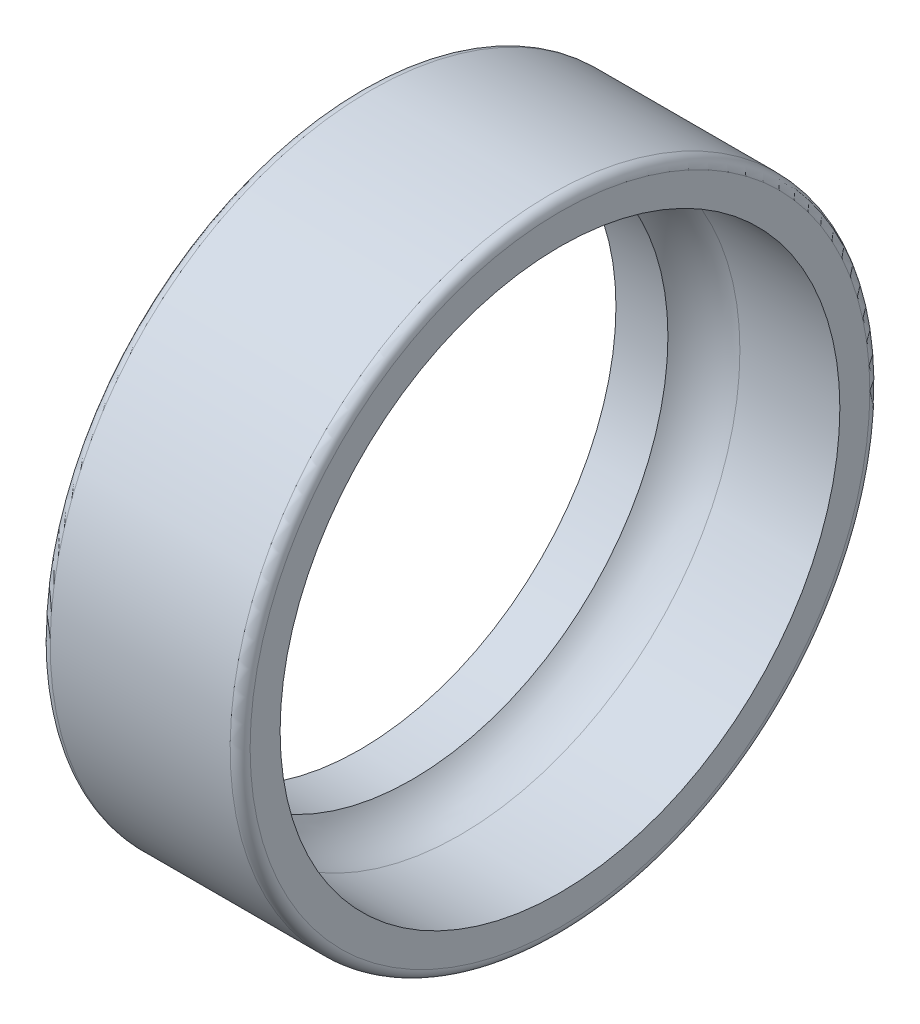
ISO-10303-21;
HEADER;
FILE_DESCRIPTION(('STEP AP214'),'2;1');
FILE_NAME('part.step','',(''),(''),'','','');
FILE_SCHEMA(('AUTOMOTIVE_DESIGN { 1 0 10303 214 1 1 1 1 }'));
ENDSEC;
DATA;
#1=APPLICATION_CONTEXT('core data for automotive mechanical design processes');
#2=APPLICATION_PROTOCOL_DEFINITION('international standard','automotive_design',2000,#1);
#3=PRODUCT_CONTEXT('',#1,'mechanical');
#4=PRODUCT('Part','Part','',(#3));
#5=PRODUCT_RELATED_PRODUCT_CATEGORY('part','',(#4));
#6=PRODUCT_DEFINITION_FORMATION('','',#4);
#7=PRODUCT_DEFINITION_CONTEXT('part definition',#1,'design');
#8=PRODUCT_DEFINITION('design','',#6,#7);
#9=PRODUCT_DEFINITION_SHAPE('','',#8);
#10=(LENGTH_UNIT() NAMED_UNIT(*) SI_UNIT(.MILLI.,.METRE.));
#11=(NAMED_UNIT(*) PLANE_ANGLE_UNIT() SI_UNIT($,.RADIAN.));
#12=(NAMED_UNIT(*) SI_UNIT($,.STERADIAN.) SOLID_ANGLE_UNIT());
#13=UNCERTAINTY_MEASURE_WITH_UNIT(LENGTH_MEASURE(1.E-05),#10,'distance_accuracy_value','');
#14=(GEOMETRIC_REPRESENTATION_CONTEXT(3) GLOBAL_UNCERTAINTY_ASSIGNED_CONTEXT((#13)) GLOBAL_UNIT_ASSIGNED_CONTEXT((#10,
#11,#12)) REPRESENTATION_CONTEXT('',''));
#15=CARTESIAN_POINT('',(0.,0.,0.));
#16=DIRECTION('',(0.,0.,1.));
#17=DIRECTION('',(1.,0.,0.));
#18=AXIS2_PLACEMENT_3D('',#15,#16,#17);
#19=CARTESIAN_POINT('',(0.,14.15,0.));
#20=DIRECTION('',(-1.,0.,0.));
#21=DIRECTION('',(0.,0.,1.));
#22=AXIS2_PLACEMENT_3D('',#19,#20,#21);
#23=PLANE('',#22);
#24=CARTESIAN_POINT('',(0.,0.,0.));
#25=DIRECTION('',(-1.,0.,0.));
#26=DIRECTION('',(0.,1.,0.));
#27=AXIS2_PLACEMENT_3D('',#24,#25,#26);
#28=CIRCLE('',#27,12.8);
#29=CARTESIAN_POINT('',(0.,12.8,0.));
#30=VERTEX_POINT('',#29);
#31=EDGE_CURVE('E33',#30,#30,#28,.T.);
#32=ORIENTED_EDGE('',*,*,#31,.F.);
#33=EDGE_LOOP('',(#32));
#34=FACE_BOUND('',#33,.T.);
#35=CARTESIAN_POINT('',(0.,0.,0.));
#36=DIRECTION('',(-1.,0.,0.));
#37=DIRECTION('',(0.,1.,0.));
#38=AXIS2_PLACEMENT_3D('',#35,#36,#37);
#39=CIRCLE('',#38,15.5);
#40=CARTESIAN_POINT('',(0.,15.5,0.));
#41=VERTEX_POINT('',#40);
#42=EDGE_CURVE('E10',#41,#41,#39,.T.);
#43=ORIENTED_EDGE('',*,*,#42,.T.);
#44=EDGE_LOOP('',(#43));
#45=FACE_BOUND('',#44,.T.);
#46=ADVANCED_FACE('F15',(#34,#45),#23,.T.);
#47=CARTESIAN_POINT('',(10.,14.75,0.));
#48=DIRECTION('',(1.,0.,0.));
#49=DIRECTION('',(0.,0.,-1.));
#50=AXIS2_PLACEMENT_3D('',#47,#48,#49);
#51=PLANE('',#50);
#52=CARTESIAN_POINT('',(10.,0.,0.));
#53=DIRECTION('',(-1.,0.,0.));
#54=DIRECTION('',(0.,1.,0.));
#55=AXIS2_PLACEMENT_3D('',#52,#53,#54);
#56=CIRCLE('',#55,14.);
#57=CARTESIAN_POINT('',(10.,14.,0.));
#58=VERTEX_POINT('',#57);
#59=EDGE_CURVE('E24',#58,#58,#56,.T.);
#60=ORIENTED_EDGE('',*,*,#59,.T.);
#61=EDGE_LOOP('',(#60));
#62=FACE_BOUND('',#61,.T.);
#63=CARTESIAN_POINT('',(10.,0.,0.));
#64=DIRECTION('',(-1.,0.,0.));
#65=DIRECTION('',(0.,1.,0.));
#66=AXIS2_PLACEMENT_3D('',#63,#64,#65);
#67=CIRCLE('',#66,15.5);
#68=CARTESIAN_POINT('',(10.,15.5,0.));
#69=VERTEX_POINT('',#68);
#70=EDGE_CURVE('E81',#69,#69,#67,.T.);
#71=ORIENTED_EDGE('',*,*,#70,.F.);
#72=EDGE_LOOP('',(#71));
#73=FACE_BOUND('',#72,.T.);
#74=ADVANCED_FACE('F46',(#62,#73),#51,.T.);
#75=CARTESIAN_POINT('',(1.3,0.,0.));
#76=DIRECTION('',(-1.,0.,0.));
#77=DIRECTION('',(0.,0.,1.));
#78=AXIS2_PLACEMENT_3D('',#75,#76,#77);
#79=CYLINDRICAL_SURFACE('',#78,12.8);
#80=CARTESIAN_POINT('',(2.6,0.,0.));
#81=DIRECTION('',(-1.,0.,0.));
#82=DIRECTION('',(0.,1.,0.));
#83=AXIS2_PLACEMENT_3D('',#80,#81,#82);
#84=CIRCLE('',#83,12.8);
#85=CARTESIAN_POINT('',(2.6,12.8,0.));
#86=VERTEX_POINT('',#85);
#87=EDGE_CURVE('E75',#86,#86,#84,.T.);
#88=ORIENTED_EDGE('',*,*,#87,.F.);
#89=EDGE_LOOP('',(#88));
#90=FACE_BOUND('',#89,.T.);
#91=ORIENTED_EDGE('',*,*,#31,.T.);
#92=EDGE_LOOP('',(#91));
#93=FACE_BOUND('',#92,.T.);
#94=ADVANCED_FACE('F44',(#90,#93),#79,.F.);
#95=CARTESIAN_POINT('',(5.,0.,0.));
#96=DIRECTION('',(-1.,0.,0.));
#97=DIRECTION('',(0.,0.,1.));
#98=AXIS2_PLACEMENT_3D('',#95,#96,#97);
#99=TOROIDAL_SURFACE('',#98,11.,3.);
#100=ORIENTED_EDGE('',*,*,#87,.T.);
#101=EDGE_LOOP('',(#100));
#102=FACE_BOUND('',#101,.T.);
#103=CARTESIAN_POINT('',(5.,0.,0.));
#104=DIRECTION('',(-1.,0.,0.));
#105=DIRECTION('',(0.,1.,0.));
#106=AXIS2_PLACEMENT_3D('',#103,#104,#105);
#107=CIRCLE('',#106,14.);
#108=CARTESIAN_POINT('',(5.,14.,0.));
#109=VERTEX_POINT('',#108);
#110=EDGE_CURVE('E93',#109,#109,#107,.T.);
#111=ORIENTED_EDGE('',*,*,#110,.F.);
#112=EDGE_LOOP('',(#111));
#113=FACE_BOUND('',#112,.T.);
#114=ADVANCED_FACE('F40',(#102,#113),#99,.F.);
#115=CARTESIAN_POINT('',(7.5,0.,0.));
#116=DIRECTION('',(-1.,0.,0.));
#117=DIRECTION('',(0.,0.,1.));
#118=AXIS2_PLACEMENT_3D('',#115,#116,#117);
#119=CYLINDRICAL_SURFACE('',#118,14.);
#120=ORIENTED_EDGE('',*,*,#59,.F.);
#121=EDGE_LOOP('',(#120));
#122=FACE_BOUND('',#121,.T.);
#123=ORIENTED_EDGE('',*,*,#110,.T.);
#124=EDGE_LOOP('',(#123));
#125=FACE_BOUND('',#124,.T.);
#126=ADVANCED_FACE('F17',(#122,#125),#119,.F.);
#127=CARTESIAN_POINT('',(9.5,0.,0.));
#128=DIRECTION('',(-1.,0.,0.));
#129=DIRECTION('',(0.,0.,1.));
#130=AXIS2_PLACEMENT_3D('',#127,#128,#129);
#131=TOROIDAL_SURFACE('',#130,15.5,0.500000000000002);
#132=ORIENTED_EDGE('',*,*,#70,.T.);
#133=EDGE_LOOP('',(#132));
#134=FACE_BOUND('',#133,.T.);
#135=CARTESIAN_POINT('',(9.5,0.,0.));
#136=DIRECTION('',(-1.,0.,0.));
#137=DIRECTION('',(0.,1.,0.));
#138=AXIS2_PLACEMENT_3D('',#135,#136,#137);
#139=CIRCLE('',#138,16.);
#140=CARTESIAN_POINT('',(9.5,16.,0.));
#141=VERTEX_POINT('',#140);
#142=EDGE_CURVE('E84',#141,#141,#139,.T.);
#143=ORIENTED_EDGE('',*,*,#142,.F.);
#144=EDGE_LOOP('',(#143));
#145=FACE_BOUND('',#144,.T.);
#146=ADVANCED_FACE('F48',(#134,#145),#131,.T.);
#147=CARTESIAN_POINT('',(5.,0.,0.));
#148=DIRECTION('',(-1.,0.,0.));
#149=DIRECTION('',(0.,0.,1.));
#150=AXIS2_PLACEMENT_3D('',#147,#148,#149);
#151=CYLINDRICAL_SURFACE('',#150,16.);
#152=CARTESIAN_POINT('',(0.5,0.,0.));
#153=DIRECTION('',(-1.,0.,0.));
#154=DIRECTION('',(0.,1.,0.));
#155=AXIS2_PLACEMENT_3D('',#152,#153,#154);
#156=CIRCLE('',#155,16.);
#157=CARTESIAN_POINT('',(0.5,16.,0.));
#158=VERTEX_POINT('',#157);
#159=EDGE_CURVE('E87',#158,#158,#156,.T.);
#160=ORIENTED_EDGE('',*,*,#159,.F.);
#161=EDGE_LOOP('',(#160));
#162=FACE_BOUND('',#161,.T.);
#163=ORIENTED_EDGE('',*,*,#142,.T.);
#164=EDGE_LOOP('',(#163));
#165=FACE_BOUND('',#164,.T.);
#166=ADVANCED_FACE('F51',(#162,#165),#151,.T.);
#167=CARTESIAN_POINT('',(0.500000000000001,0.,0.));
#168=DIRECTION('',(-1.,0.,0.));
#169=DIRECTION('',(0.,0.,1.));
#170=AXIS2_PLACEMENT_3D('',#167,#168,#169);
#171=TOROIDAL_SURFACE('',#170,15.5,0.500000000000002);
#172=ORIENTED_EDGE('',*,*,#159,.T.);
#173=EDGE_LOOP('',(#172));
#174=FACE_BOUND('',#173,.T.);
#175=ORIENTED_EDGE('',*,*,#42,.F.);
#176=EDGE_LOOP('',(#175));
#177=FACE_BOUND('',#176,.T.);
#178=ADVANCED_FACE('F55',(#174,#177),#171,.T.);
#179=CLOSED_SHELL('',(#46,#74,#94,#114,#126,#146,#166,#178));
#180=MANIFOLD_SOLID_BREP('B1',#179);
#181=ADVANCED_BREP_SHAPE_REPRESENTATION('',(#18,#180),#14);
#182=SHAPE_DEFINITION_REPRESENTATION(#9,#181);
ENDSEC;
END-ISO-10303-21;
